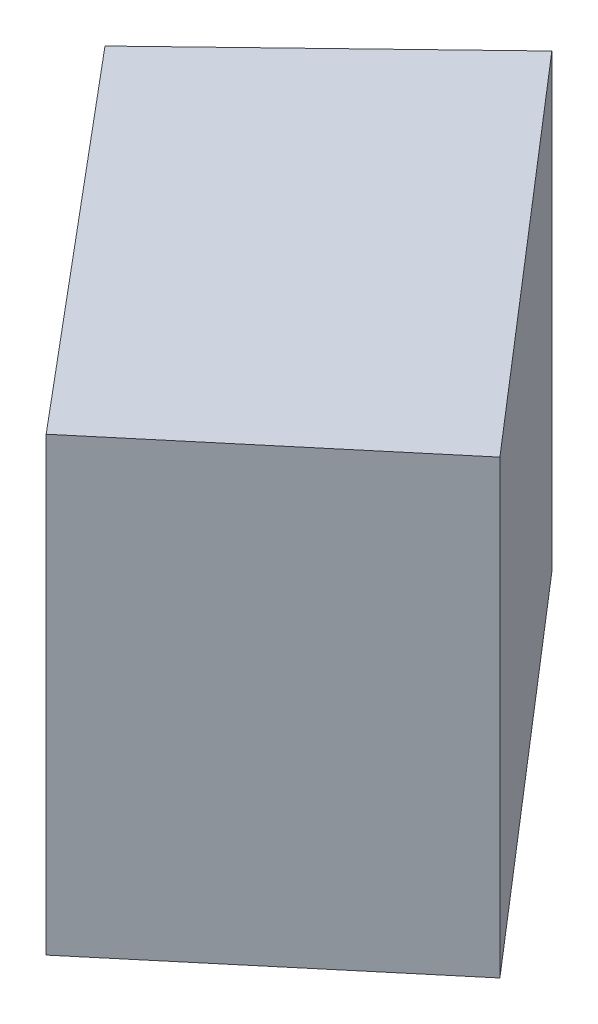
ISO-10303-21;
HEADER;
FILE_DESCRIPTION(('STEP AP214'),'2;1');
FILE_NAME('part.step','',(''),(''),'','','');
FILE_SCHEMA(('AUTOMOTIVE_DESIGN { 1 0 10303 214 1 1 1 1 }'));
ENDSEC;
DATA;
#1=APPLICATION_CONTEXT('core data for automotive mechanical design processes');
#2=APPLICATION_PROTOCOL_DEFINITION('international standard','automotive_design',2000,#1);
#3=PRODUCT_CONTEXT('',#1,'mechanical');
#4=PRODUCT('Part','Part','',(#3));
#5=PRODUCT_RELATED_PRODUCT_CATEGORY('part','',(#4));
#6=PRODUCT_DEFINITION_FORMATION('','',#4);
#7=PRODUCT_DEFINITION_CONTEXT('part definition',#1,'design');
#8=PRODUCT_DEFINITION('design','',#6,#7);
#9=PRODUCT_DEFINITION_SHAPE('','',#8);
#10=(LENGTH_UNIT() NAMED_UNIT(*) SI_UNIT(.MILLI.,.METRE.));
#11=(NAMED_UNIT(*) PLANE_ANGLE_UNIT() SI_UNIT($,.RADIAN.));
#12=(NAMED_UNIT(*) SI_UNIT($,.STERADIAN.) SOLID_ANGLE_UNIT());
#13=UNCERTAINTY_MEASURE_WITH_UNIT(LENGTH_MEASURE(1.E-05),#10,'distance_accuracy_value','');
#14=(GEOMETRIC_REPRESENTATION_CONTEXT(3) GLOBAL_UNCERTAINTY_ASSIGNED_CONTEXT((#13)) GLOBAL_UNIT_ASSIGNED_CONTEXT((#10,
#11,#12)) REPRESENTATION_CONTEXT('',''));
#15=CARTESIAN_POINT('',(0.,0.,0.));
#16=DIRECTION('',(0.,0.,1.));
#17=DIRECTION('',(1.,0.,0.));
#18=AXIS2_PLACEMENT_3D('',#15,#16,#17);
#19=CARTESIAN_POINT('',(9423.57255467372,0.,-22338.2470283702));
#20=DIRECTION('',(0.,-1.,0.));
#21=DIRECTION('',(0.,0.,-1.));
#22=AXIS2_PLACEMENT_3D('',#19,#20,#21);
#23=PLANE('',#22);
#24=DIRECTION('',(0.720760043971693,0.,-0.693184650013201));
#25=VECTOR('',#24,1.);
#26=CARTESIAN_POINT('',(4374.01554924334,0.,-17481.8798714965));
#27=LINE('',#26,#25);
#28=CARTESIAN_POINT('',(4374.01554924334,0.,-17481.8798714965));
#29=VERTEX_POINT('',#28);
#30=CARTESIAN_POINT('',(9423.57255467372,0.,-22338.2470283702));
#31=VERTEX_POINT('',#30);
#32=EDGE_CURVE('E221',#29,#31,#27,.T.);
#33=ORIENTED_EDGE('',*,*,#32,.F.);
#34=DIRECTION('',(-0.642787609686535,0.,-0.766044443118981));
#35=VECTOR('',#34,1.);
#36=CARTESIAN_POINT('',(11174.9231065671,0.,-9376.87385715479));
#37=LINE('',#36,#35);
#38=CARTESIAN_POINT('',(11174.9231065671,0.,-9376.87385715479));
#39=VERTEX_POINT('',#38);
#40=EDGE_CURVE('E86',#39,#29,#37,.T.);
#41=ORIENTED_EDGE('',*,*,#40,.F.);
#42=DIRECTION('',(-0.766044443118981,0.,0.642787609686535));
#43=VECTOR('',#42,1.);
#44=CARTESIAN_POINT('',(16644.1861664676,0.,-13966.1304735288));
#45=LINE('',#44,#43);
#46=CARTESIAN_POINT('',(16644.1861664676,0.,-13966.1304735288));
#47=VERTEX_POINT('',#46);
#48=EDGE_CURVE('E192',#47,#39,#45,.T.);
#49=ORIENTED_EDGE('',*,*,#48,.F.);
#50=DIRECTION('',(0.653109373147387,0.,0.757263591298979));
#51=VECTOR('',#50,1.);
#52=CARTESIAN_POINT('',(9423.57255467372,0.,-22338.2470283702));
#53=LINE('',#52,#51);
#54=EDGE_CURVE('E127',#31,#47,#53,.T.);
#55=ORIENTED_EDGE('',*,*,#54,.F.);
#56=EDGE_LOOP('',(#33,#41,#49,#55));
#57=FACE_BOUND('',#56,.T.);
#58=ADVANCED_FACE('F51',(#57),#23,.F.);
#59=CARTESIAN_POINT('',(11174.9231065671,-10000.,-9376.87385715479));
#60=DIRECTION('',(0.,1.,0.));
#61=DIRECTION('',(0.,0.,1.));
#62=AXIS2_PLACEMENT_3D('',#59,#60,#61);
#63=PLANE('',#62);
#64=DIRECTION('',(-0.642787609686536,0.,-0.766044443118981));
#65=VECTOR('',#64,1.);
#66=CARTESIAN_POINT('',(4374.01554924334,-10000.,-17481.8798714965));
#67=LINE('',#66,#65);
#68=CARTESIAN_POINT('',(11174.9231065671,-10000.,-9376.87385715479));
#69=VERTEX_POINT('',#68);
#70=CARTESIAN_POINT('',(4374.01554924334,-10000.,-17481.8798714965));
#71=VERTEX_POINT('',#70);
#72=EDGE_CURVE('E120',#69,#71,#67,.T.);
#73=ORIENTED_EDGE('',*,*,#72,.T.);
#74=DIRECTION('',(0.720760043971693,0.,-0.693184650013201));
#75=VECTOR('',#74,1.);
#76=CARTESIAN_POINT('',(9423.57255467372,-10000.,-22338.2470283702));
#77=LINE('',#76,#75);
#78=CARTESIAN_POINT('',(9423.57255467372,-10000.,-22338.2470283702));
#79=VERTEX_POINT('',#78);
#80=EDGE_CURVE('E13',#71,#79,#77,.T.);
#81=ORIENTED_EDGE('',*,*,#80,.T.);
#82=DIRECTION('',(0.653109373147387,0.,0.757263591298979));
#83=VECTOR('',#82,1.);
#84=CARTESIAN_POINT('',(16644.1861664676,-10000.,-13966.1304735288));
#85=LINE('',#84,#83);
#86=CARTESIAN_POINT('',(16644.1861664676,-10000.,-13966.1304735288));
#87=VERTEX_POINT('',#86);
#88=EDGE_CURVE('E62',#79,#87,#85,.T.);
#89=ORIENTED_EDGE('',*,*,#88,.T.);
#90=DIRECTION('',(-0.766044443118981,0.,0.642787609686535));
#91=VECTOR('',#90,1.);
#92=CARTESIAN_POINT('',(11174.9231065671,-10000.,-9376.87385715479));
#93=LINE('',#92,#91);
#94=EDGE_CURVE('E98',#87,#69,#93,.T.);
#95=ORIENTED_EDGE('',*,*,#94,.T.);
#96=EDGE_LOOP('',(#73,#81,#89,#95));
#97=FACE_BOUND('',#96,.T.);
#98=ADVANCED_FACE('F102',(#97),#63,.F.);
#99=CARTESIAN_POINT('',(9423.57255467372,0.,-22338.2470283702));
#100=DIRECTION('',(0.757263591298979,0.,-0.653109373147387));
#101=DIRECTION('',(-0.653109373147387,0.,-0.757263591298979));
#102=AXIS2_PLACEMENT_3D('',#99,#100,#101);
#103=PLANE('',#102);
#104=CARTESIAN_POINT('',(9423.57255467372,-10000.,-22338.2470283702));
#105=DIRECTION('',(0.,1.,0.));
#106=VECTOR('',#105,1.);
#107=LINE('',#104,#106);
#108=EDGE_CURVE('E129',#79,#31,#107,.T.);
#109=ORIENTED_EDGE('',*,*,#108,.T.);
#110=ORIENTED_EDGE('',*,*,#54,.T.);
#111=CARTESIAN_POINT('',(16644.1861664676,-10000.,-13966.1304735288));
#112=DIRECTION('',(0.,1.,0.));
#113=VECTOR('',#112,1.);
#114=LINE('',#111,#113);
#115=EDGE_CURVE('E116',#87,#47,#114,.T.);
#116=ORIENTED_EDGE('',*,*,#115,.F.);
#117=ORIENTED_EDGE('',*,*,#88,.F.);
#118=EDGE_LOOP('',(#109,#110,#116,#117));
#119=FACE_BOUND('',#118,.T.);
#120=ADVANCED_FACE('F126',(#119),#103,.T.);
#121=CARTESIAN_POINT('',(11174.9231065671,-10000.,-9376.87385715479));
#122=DIRECTION('',(0.642787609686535,0.,0.766044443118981));
#123=DIRECTION('',(0.766044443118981,0.,-0.642787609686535));
#124=AXIS2_PLACEMENT_3D('',#121,#122,#123);
#125=PLANE('',#124);
#126=ORIENTED_EDGE('',*,*,#94,.F.);
#127=ORIENTED_EDGE('',*,*,#115,.T.);
#128=ORIENTED_EDGE('',*,*,#48,.T.);
#129=DIRECTION('',(0.,1.,0.));
#130=VECTOR('',#129,1.);
#131=CARTESIAN_POINT('',(11174.9231065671,-5000.,-9376.87385715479));
#132=LINE('',#131,#130);
#133=EDGE_CURVE('E119',#69,#39,#132,.T.);
#134=ORIENTED_EDGE('',*,*,#133,.F.);
#135=EDGE_LOOP('',(#126,#127,#128,#134));
#136=FACE_BOUND('',#135,.T.);
#137=ADVANCED_FACE('F115',(#136),#125,.T.);
#138=CARTESIAN_POINT('',(4374.01554924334,-10000.,-17481.8798714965));
#139=DIRECTION('',(-0.766044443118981,0.,0.642787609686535));
#140=DIRECTION('',(0.642787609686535,0.,0.766044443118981));
#141=AXIS2_PLACEMENT_3D('',#138,#139,#140);
#142=PLANE('',#141);
#143=ORIENTED_EDGE('',*,*,#72,.F.);
#144=ORIENTED_EDGE('',*,*,#133,.T.);
#145=ORIENTED_EDGE('',*,*,#40,.T.);
#146=DIRECTION('',(0.,1.,0.));
#147=VECTOR('',#146,1.);
#148=CARTESIAN_POINT('',(4374.01554924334,-5000.,-17481.8798714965));
#149=LINE('',#148,#147);
#150=EDGE_CURVE('E71',#71,#29,#149,.T.);
#151=ORIENTED_EDGE('',*,*,#150,.F.);
#152=EDGE_LOOP('',(#143,#144,#145,#151));
#153=FACE_BOUND('',#152,.T.);
#154=ADVANCED_FACE('F169',(#153),#142,.T.);
#155=CARTESIAN_POINT('',(9423.57255467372,-10000.,-22338.2470283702));
#156=DIRECTION('',(-0.693184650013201,0.,-0.720760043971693));
#157=DIRECTION('',(-0.720760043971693,0.,0.693184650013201));
#158=AXIS2_PLACEMENT_3D('',#155,#156,#157);
#159=PLANE('',#158);
#160=ORIENTED_EDGE('',*,*,#80,.F.);
#161=ORIENTED_EDGE('',*,*,#150,.T.);
#162=ORIENTED_EDGE('',*,*,#32,.T.);
#163=ORIENTED_EDGE('',*,*,#108,.F.);
#164=EDGE_LOOP('',(#160,#161,#162,#163));
#165=FACE_BOUND('',#164,.T.);
#166=ADVANCED_FACE('F145',(#165),#159,.T.);
#167=CLOSED_SHELL('',(#58,#98,#120,#137,#154,#166));
#168=MANIFOLD_SOLID_BREP('B2',#167);
#169=ADVANCED_BREP_SHAPE_REPRESENTATION('',(#18,#168),#14);
#170=SHAPE_DEFINITION_REPRESENTATION(#9,#169);
ENDSEC;
END-ISO-10303-21;
